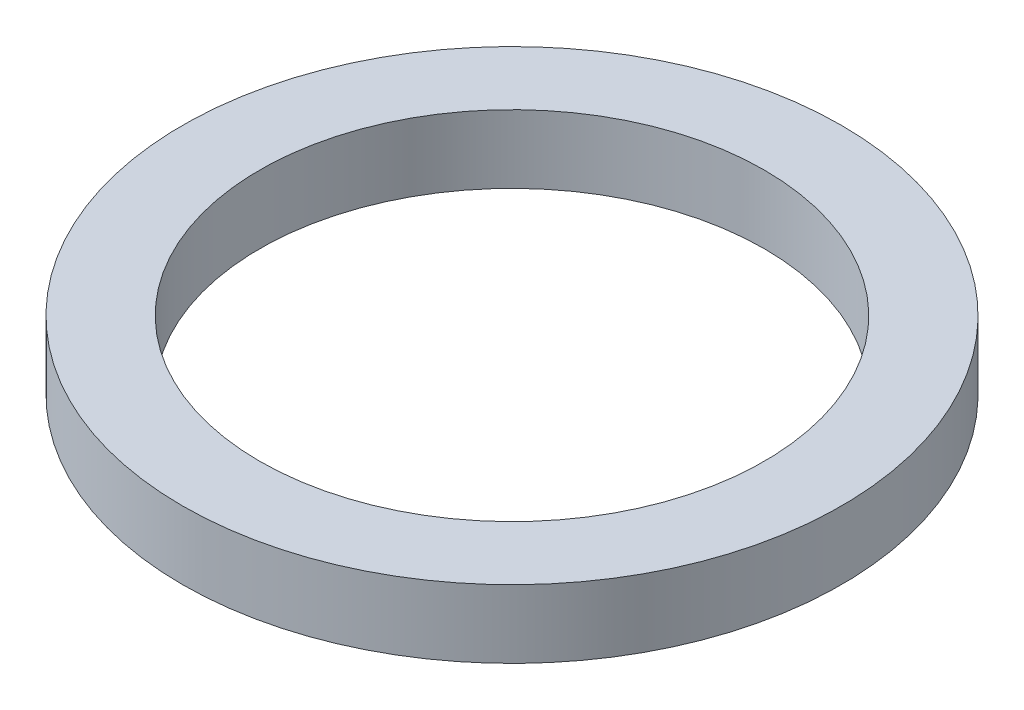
from build123d import *

# Parameters (mm, degrees)
SKETCH_2_W = 3.4
SKETCH_2_H = 3


with BuildPart() as part:
    # Sketch 2 → Revolve 1 (revolve)
    with BuildSketch(Plane(origin=(0, 0, 0), x_dir=(0, 0, -1), z_dir=(1, 0, 0)), mode=Mode.PRIVATE) as revolve_1_sk:
        with Locations((12.8, -1.5)):
            Rectangle(SKETCH_2_W, SKETCH_2_H)
    revolve(revolve_1_sk.sketch.rotate(Axis((0, 18.848878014, 0), (0, -1, 0)), 180), axis=Axis((0, 18.848878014, 0), (0, -1, 0)))


solid = part.part
